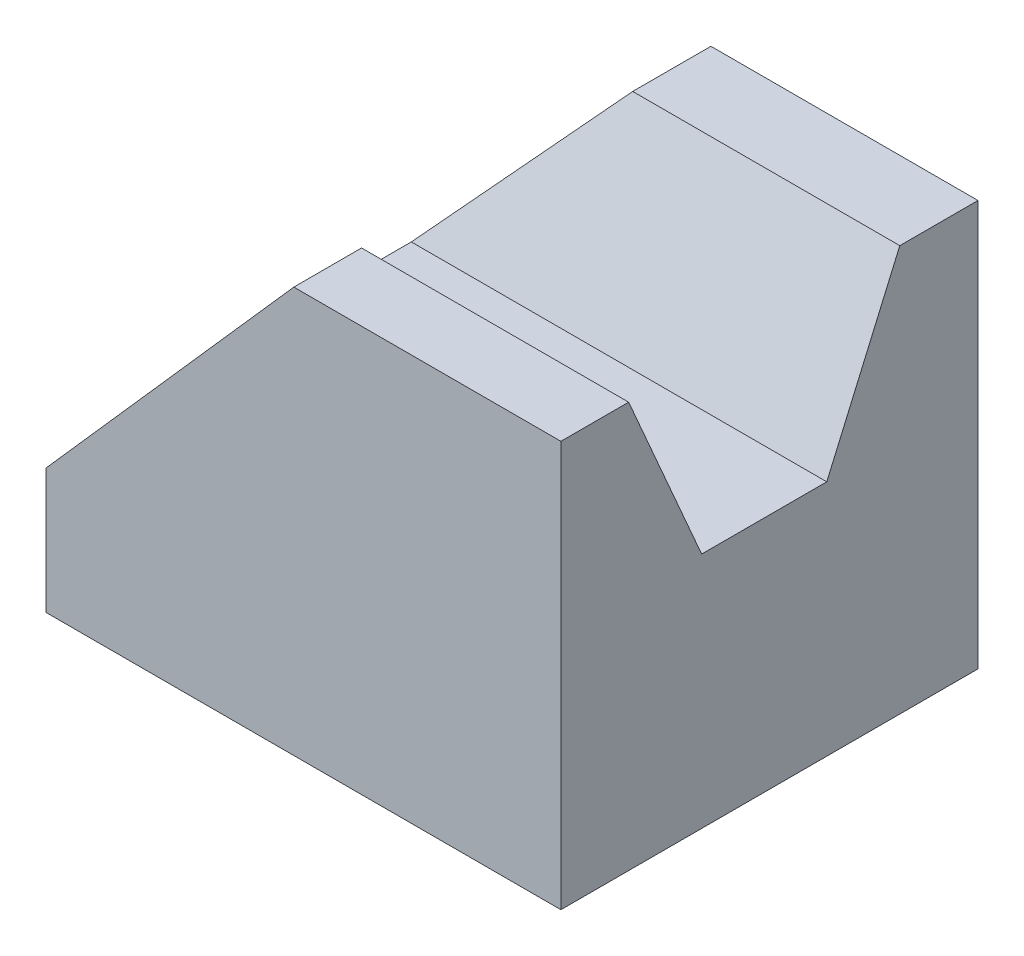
from build123d import *

# Parameters (mm, degrees)
SKETCH_1_W               = 49.377122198
SKETCH_1_H               = 38.903576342
EXTRUDE_1_DEPTH          = 40
CUT_EXTRUDE_1_DEPTH      = 51.871378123
CUT_EXTRUDE_2_DEPTH      = 51.871378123
CUT_EXTRUDE_2_DEPTH_BACK = 51.871378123


with BuildPart() as part:
    # Sketch 1 → Extrude 1 (new body)
    with BuildSketch(Plane.XY):
        Rectangle(SKETCH_1_W, SKETCH_1_H)
    extrude(amount=EXTRUDE_1_DEPTH)

    # Sketch 2 → Cut-Extrude 1 (cut, through all)
    with BuildSketch(Plane.XY):
        Polygon((-0.924713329, 19.451788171), (-24.688561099, -7.456023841), (-24.688561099, 19.451788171), align=None)
    extrude(amount=CUT_EXTRUDE_1_DEPTH, mode=Mode.SUBTRACT)

    # Sketch 3 → Cut-Extrude 2 (cut, two sides: drawn at the far end of the back side and taken through both)
    with BuildSketch(Plane(origin=(0, 0, 0), x_dir=(0, 0, -1), z_dir=(1, 0, 0)).offset(-CUT_EXTRUDE_2_DEPTH_BACK)):
        Polygon((-33.501497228, 19.451788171), (-26.501497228, 3.337241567), (-14.501497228, 3.337241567), (-7.501497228, 19.451788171), align=None)
    extrude(amount=CUT_EXTRUDE_2_DEPTH + CUT_EXTRUDE_2_DEPTH_BACK, mode=Mode.SUBTRACT)


solid = part.part
